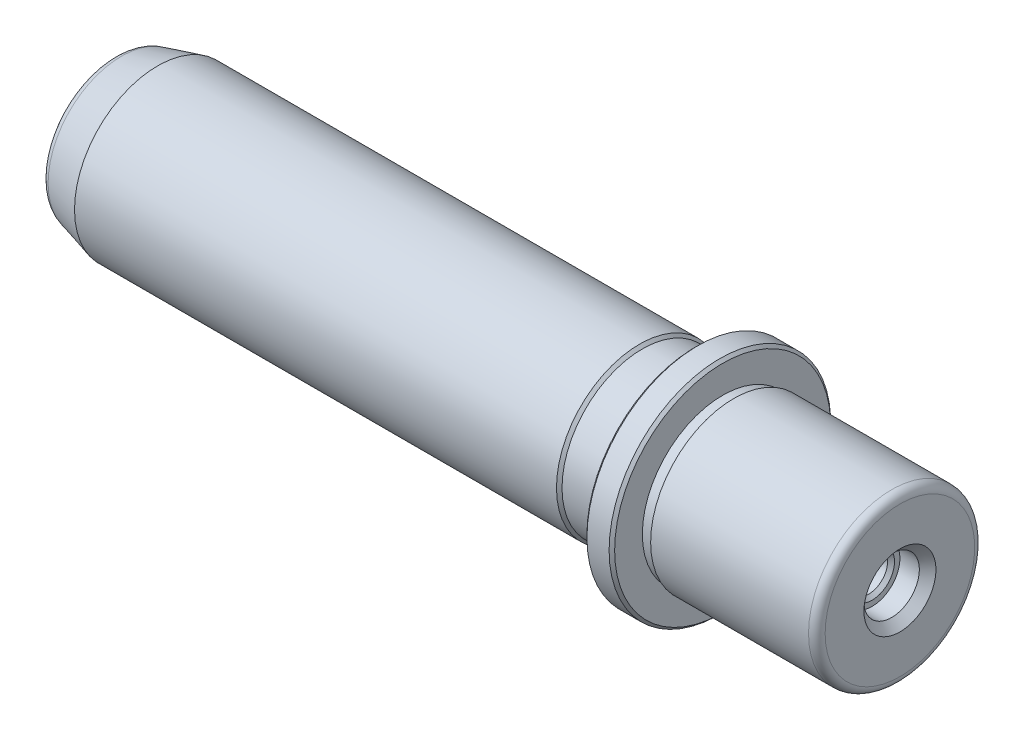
from build123d import *

# Parameters (mm, degrees)
FURO_ROSCADO_DE_M8X1_251_D                     = 6.8
FURO_ROSCADO_DE_M8X1_251_DEPTH                 = 22.25
FURO_ROSCADO_DE_M8X1_251_CSINK_D               = 8.05
FURO_ROSCADO_DE_M8X1_251_CSINK_ANGLE           = 90
FURO_ROSCADO_DE_M8X1_251_TIP                   = 2.042926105
FURO_ROSCADO_DE_M8X1_251_ON_FACE_2_D           = 6.8
FURO_ROSCADO_DE_M8X1_251_ON_FACE_2_DEPTH       = 22.25
FURO_ROSCADO_DE_M8X1_251_ON_FACE_2_CSINK_D     = 8.05
FURO_ROSCADO_DE_M8X1_251_ON_FACE_2_CSINK_ANGLE = 90
FURO_ROSCADO_DE_M8X1_251_ON_FACE_2_TIP         = 2.042926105


with BuildPart() as part:
    # Esbo_o1 → Revolu_o1 (revolve)
    with BuildSketch(Plane.XY, mode=Mode.PRIVATE) as revolu_o1_sk:
        with BuildLine():
            Line((0, 6.5), (0, 11.321752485))
            ThreePointArc((0, 11.321752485), (0.413293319, 12.539275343), (1.48236191, 13.253604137))
            Line((1.48236191, 13.253604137), (8, 15))
            Line((8, 15), (95, 15))
            Line((95, 15), (95.5, 14.5))
            Line((95.5, 14.5), (104.5, 14.5))
            Line((104.5, 14.5), (105, 15))
            Line((105, 15), (105, 19.5))
            Line((105, 19.5), (105.5, 20))
            Line((105.5, 20), (109.5, 20))
            Line((109.5, 20), (110, 19.5))
            Line((110, 19.5), (110, 14.5))
            Line((110, 14.5), (112, 14.5))
            Line((112, 14.5), (112, 15))
            Line((112, 15), (140.5, 15))
            ThreePointArc((140.5, 15), (141.560660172, 14.560660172), (142, 13.5))
            Line((142, 13.5), (142, 6.5))
            Line((142, 6.5), (140.5, 5))
            Line((140.5, 5), (137, 5))
            Line((137, 5), (137, 0))
            Line((137, 0), (5, 0))
            Line((5, 0), (5, 5))
            Line((5, 5), (1.5, 5))
            Line((1.5, 5), (0, 6.5))
        make_face()
    revolve(revolu_o1_sk.sketch.rotate(Axis((0, 0, 0), (1, 0, 0)), 90), axis=Axis((0, 0, 0), (1, 0, 0)))

    # Furo roscado de M8x1.251
    with Locations(Plane(origin=(5, 0, 0), x_dir=(0, 0, -1), z_dir=(-1, 0, 0))):
        with Locations((0, 0)):
            CounterSinkHole(FURO_ROSCADO_DE_M8X1_251_D / 2, FURO_ROSCADO_DE_M8X1_251_CSINK_D / 2, depth=FURO_ROSCADO_DE_M8X1_251_DEPTH, counter_sink_angle=FURO_ROSCADO_DE_M8X1_251_CSINK_ANGLE)
            with Locations((0, 0, -(FURO_ROSCADO_DE_M8X1_251_DEPTH + FURO_ROSCADO_DE_M8X1_251_TIP / 2))):  # 118° drill point
                Cone(0, FURO_ROSCADO_DE_M8X1_251_D / 2, FURO_ROSCADO_DE_M8X1_251_TIP, mode=Mode.SUBTRACT)

    # Furo roscado de M8x1.251 on face 2
    with Locations(Plane(origin=(137, 0, 0), x_dir=(0, 0, 1), z_dir=(1, 0, 0))):
        with Locations((0, 0)):
            CounterSinkHole(FURO_ROSCADO_DE_M8X1_251_ON_FACE_2_D / 2, FURO_ROSCADO_DE_M8X1_251_ON_FACE_2_CSINK_D / 2, depth=FURO_ROSCADO_DE_M8X1_251_ON_FACE_2_DEPTH, counter_sink_angle=FURO_ROSCADO_DE_M8X1_251_ON_FACE_2_CSINK_ANGLE)
            with Locations((0, 0, -(FURO_ROSCADO_DE_M8X1_251_ON_FACE_2_DEPTH + FURO_ROSCADO_DE_M8X1_251_ON_FACE_2_TIP / 2))):  # 118° drill point
                Cone(0, FURO_ROSCADO_DE_M8X1_251_ON_FACE_2_D / 2, FURO_ROSCADO_DE_M8X1_251_ON_FACE_2_TIP, mode=Mode.SUBTRACT)


solid = part.part
